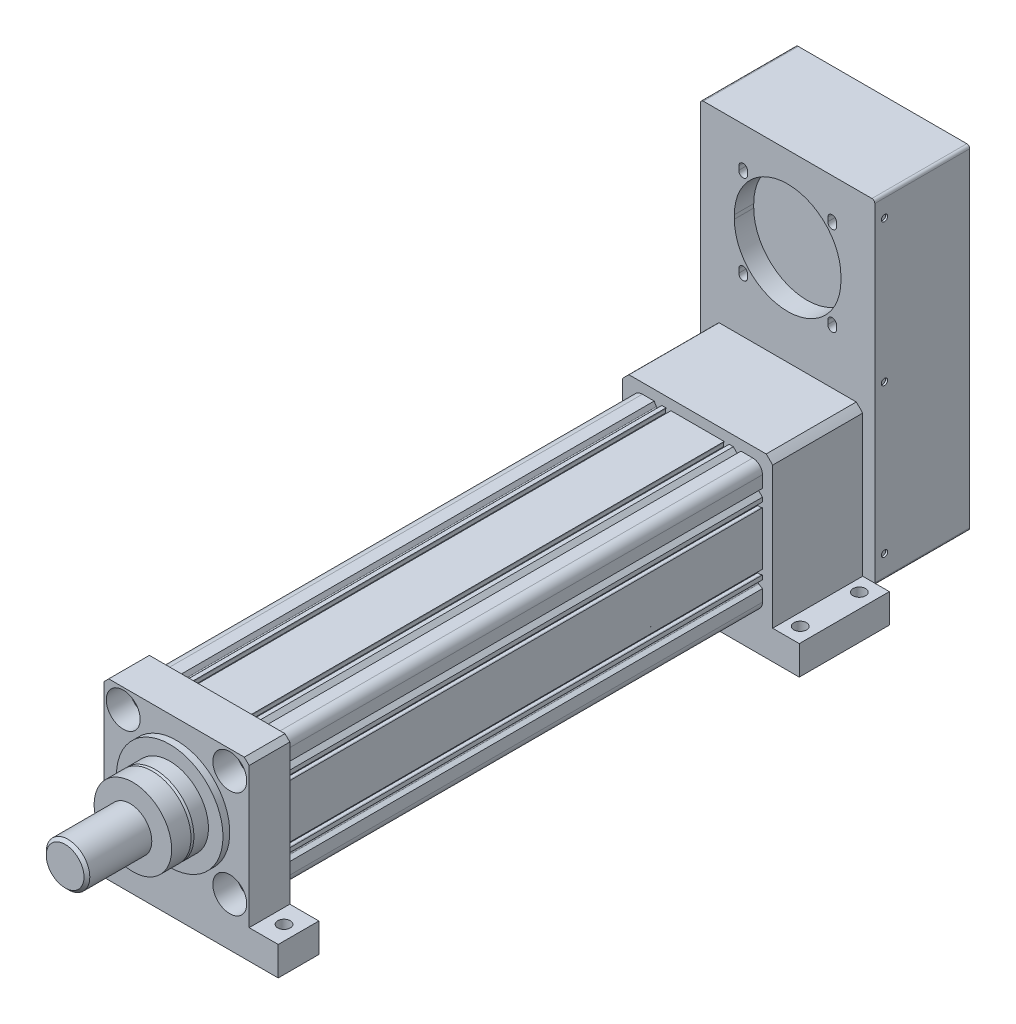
from build123d import *

# Parameters (mm, degrees)
SKETCH_1_R          = 6
EXTRUDE_1_DEPTH     = 496
EXTRUDE_1_2_DEPTH   = 42
SKETCH_3_R          = 6.5
SKETCH_3_R_2        = 8.5
CUT_EXTRUDE_1_DEPTH = 42
SKETCH_3_3_R        = 17.5
SKETCH_3_3_R_2      = 8.5
CUT_EXTRUDE_2_DEPTH = 24
SKETCH_3_4_R        = 55
EXTRUDE_2_DEPTH     = 7
SKETCH_4_R          = 40
EXTRUDE_3_DEPTH     = 18
CHAMFER_1_SIZE      = 3
CHAMFER_1_SIZE2     = 1.091910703
SKETCH_5_R          = 40
EXTRUDE_4_DEPTH     = 20
SKETCH_6_R          = 16.5
EXTRUDE_5_DEPTH     = 3
SKETCH_7_R          = 22.5
EXTRUDE_6_DEPTH     = 67
FILLET_1_R          = 1
CHAMFER_2_SIZE      = 3
EXTRUDE_7_DEPTH     = 93
SKETCH_12_W         = 180
SKETCH_12_H         = 345
EXTRUDE_9_DEPTH     = 98
CUT_EXTRUDE_5_DEPTH = 20
CUT_EXTRUDE_6_DEPTH = 20
SKETCH_15_R         = 3.25
CUT_EXTRUDE_7_DEPTH = 2
CUT_EXTRUDE_START   = -2
SKETCH_14_R         = 3.25
CUT_EXTRUDE_8_DEPTH = 2
SKETCH_16_W         = 210
SKETCH_16_H         = 93
SKETCH_16_R         = 6.5
EXTRUDE_10_DEPTH    = 27.5
SKETCH_17_W         = 210
SKETCH_17_H         = 42
SKETCH_17_R         = 6.5
EXTRUDE_11_DEPTH    = 30
FILLET_2_R          = 3
SKETCH_18_W         = 210
SKETCH_18_H         = 93
SKETCH_18_R         = 6.5
EXTRUDE_12_DEPTH    = 2.5


with BuildPart() as part:
    # Sketch 1 → Extrude 1 (new body)
    with BuildSketch(Plane.XY):
        with BuildLine():
            Line((57, 67), (44.8, 67))
            Line((44.8, 67), (42.56486134, 63.12862628))
            ThreePointArc((42.56486134, 63.12862628), (41.829362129, 62.637181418), (40.991729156, 62.921519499))
            Line((40.991729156, 62.921519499), (36.913248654, 67))
            Line((36.913248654, 67), (32.6, 67))
            Line((32.6, 67), (32.6, 66.1))
            Line((32.6, 66.1), (33.2, 65.5))
            Line((33.2, 65.5), (33.2, 62))
            Line((33.2, 62), (26.9, 62))
            Line((26.9, 62), (26.9, 65.5))
            Line((26.9, 65.5), (27.5, 66.1))
            Line((27.5, 66.1), (27.5, 67))
            Line((27.5, 67), (0, 67))
            Line((0, 67), (-27.5, 67))
            Line((-27.5, 67), (-27.5, 66.1))
            Line((-27.5, 66.1), (-26.9, 65.5))
            Line((-26.9, 65.5), (-26.9, 62))
            Line((-26.9, 62), (-33.2, 62))
            Line((-33.2, 62), (-33.2, 65.5))
            Line((-33.2, 65.5), (-32.6, 66.1))
            Line((-32.6, 66.1), (-32.6, 67))
            Line((-32.6, 67), (-36.913248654, 67))
            Line((-36.913248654, 67), (-40.991729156, 62.921519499))
            ThreePointArc((-40.991729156, 62.921519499), (-41.829362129, 62.637181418), (-42.56486134, 63.12862628))
            Line((-42.56486134, 63.12862628), (-44.8, 67))
            Line((-44.8, 67), (-57, 67))
            ThreePointArc((-57, 67), (-64.071067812, 64.071067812), (-67, 57))
            Line((-67, 57), (-67, 44.8))
            Line((-67, 44.8), (-63.12862628, 42.56486134))
            ThreePointArc((-63.12862628, 42.56486134), (-62.637181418, 41.829362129), (-62.921519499, 40.991729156))
            Line((-62.921519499, 40.991729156), (-67, 36.913248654))
            Line((-67, 36.913248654), (-67, 32.6))
            Line((-67, 32.6), (-66.1, 32.6))
            Line((-66.1, 32.6), (-65.5, 33.2))
            Line((-65.5, 33.2), (-62, 33.2))
            Line((-62, 33.2), (-62, 26.9))
            Line((-62, 26.9), (-65.5, 26.9))
            Line((-65.5, 26.9), (-66.1, 27.5))
            Line((-66.1, 27.5), (-67, 27.5))
            Line((-67, 27.5), (-67, 0))
            Line((-67, 0), (-67, -27.5))
            Line((-67, -27.5), (-66.1, -27.5))
            Line((-66.1, -27.5), (-65.5, -26.9))
            Line((-65.5, -26.9), (-62, -26.9))
            Line((-62, -26.9), (-62, -33.2))
            Line((-62, -33.2), (-65.5, -33.2))
            Line((-65.5, -33.2), (-66.1, -32.6))
            Line((-66.1, -32.6), (-67, -32.6))
            Line((-67, -32.6), (-67, -36.913248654))
            Line((-67, -36.913248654), (-62.921519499, -40.991729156))
            ThreePointArc((-62.921519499, -40.991729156), (-62.637181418, -41.829362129), (-63.12862628, -42.56486134))
            Line((-63.12862628, -42.56486134), (-67, -44.8))
            Line((-67, -44.8), (-67, -57))
            ThreePointArc((-67, -57), (-64.071067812, -64.071067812), (-57, -67))
            Line((-57, -67), (-44.8, -67))
            Line((-44.8, -67), (-42.56486134, -63.12862628))
            ThreePointArc((-42.56486134, -63.12862628), (-41.829362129, -62.637181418), (-40.991729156, -62.921519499))
            Line((-40.991729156, -62.921519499), (-36.913248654, -67))
            Line((-36.913248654, -67), (36.913248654, -67))
            Line((36.913248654, -67), (40.991729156, -62.921519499))
            ThreePointArc((40.991729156, -62.921519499), (41.829362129, -62.637181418), (42.56486134, -63.12862628))
            Line((42.56486134, -63.12862628), (44.8, -67))
            Line((44.8, -67), (57, -67))
            ThreePointArc((57, -67), (64.071067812, -64.071067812), (67, -57))
            Line((67, -57), (67, -44.8))
            Line((67, -44.8), (63.12862628, -42.56486134))
            ThreePointArc((63.12862628, -42.56486134), (62.637181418, -41.829362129), (62.921519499, -40.991729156))
            Line((62.921519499, -40.991729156), (67, -36.913248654))
            Line((67, -36.913248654), (67, -32.6))
            Line((67, -32.6), (66.1, -32.6))
            Line((66.1, -32.6), (65.5, -33.2))
            Line((65.5, -33.2), (62, -33.2))
            Line((62, -33.2), (62, -26.9))
            Line((62, -26.9), (65.5, -26.9))
            Line((65.5, -26.9), (66.1, -27.5))
            Line((66.1, -27.5), (67, -27.5))
            Line((67, -27.5), (67, 0))
            Line((67, 0), (67, 27.5))
            Line((67, 27.5), (66.1, 27.5))
            Line((66.1, 27.5), (65.5, 26.9))
            Line((65.5, 26.9), (62, 26.9))
            Line((62, 26.9), (62, 33.2))
            Line((62, 33.2), (65.5, 33.2))
            Line((65.5, 33.2), (66.1, 32.6))
            Line((66.1, 32.6), (67, 32.6))
            Line((67, 32.6), (67, 36.913248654))
            Line((67, 36.913248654), (62.921519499, 40.991729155))
            ThreePointArc((62.921519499, 40.991729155), (62.637181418, 41.829362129), (63.12862628, 42.56486134))
            Line((63.12862628, 42.56486134), (67, 44.8))
            Line((67, 44.8), (67, 57))
            ThreePointArc((67, 57), (64.071067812, 64.071067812), (57, 67))
        make_face()
        with Locations((-55, 55)):
            Circle(SKETCH_1_R, mode=Mode.SUBTRACT)
        with Locations((55, 55)):
            Circle(SKETCH_1_R, mode=Mode.SUBTRACT)
        with Locations((-55, -55)):
            Circle(SKETCH_1_R, mode=Mode.SUBTRACT)
        with Locations((55, -55)):
            Circle(SKETCH_1_R, mode=Mode.SUBTRACT)
        with BuildLine():
            Line((41.774779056, 51.785063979), (43.601329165, 54.94874157))
            ThreePointArc((43.601329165, 54.94874157), (43.701229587, 55.707560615), (43.235303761, 56.314766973))
            Line((43.235303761, 56.314766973), (39.616756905, 58.403935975))
            ThreePointArc((39.616756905, 58.403935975), (39.337726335, 58.513191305), (39.038853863, 58.534871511))
            Line((39.038853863, 58.534871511), (35.747329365, 58.277670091))
            ThreePointArc((35.747329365, 58.277670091), (35.481311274, 58.1068038), (35.28193171, 57.86142918))
            Line((35.28193171, 57.86142918), (34.274000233, 56.115640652))
            ThreePointArc((34.274000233, 56.115640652), (34.174099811, 55.356821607), (34.640025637, 54.749615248))
            Line((34.640025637, 54.749615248), (40.408753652, 51.419038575))
            ThreePointArc((40.408753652, 51.419038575), (41.167572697, 51.319138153), (41.774779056, 51.785063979))
        make_face(mode=Mode.SUBTRACT)
        with BuildLine():
            Line((51.785063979, 41.774779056), (54.94874157, 43.601329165))
            ThreePointArc((54.94874157, 43.601329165), (55.707560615, 43.701229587), (56.314766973, 43.235303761))
            Line((56.314766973, 43.235303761), (58.403935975, 39.616756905))
            ThreePointArc((58.403935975, 39.616756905), (58.513191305, 39.337726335), (58.534871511, 39.038853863))
            Line((58.534871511, 39.038853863), (58.277670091, 35.747329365))
            ThreePointArc((58.277670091, 35.747329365), (58.1068038, 35.481311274), (57.86142918, 35.28193171))
            Line((57.86142918, 35.28193171), (56.115640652, 34.274000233))
            ThreePointArc((56.115640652, 34.274000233), (55.356821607, 34.174099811), (54.749615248, 34.640025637))
            Line((54.749615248, 34.640025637), (51.419038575, 40.408753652))
            ThreePointArc((51.419038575, 40.408753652), (51.319138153, 41.167572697), (51.785063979, 41.774779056))
        make_face(mode=Mode.SUBTRACT)
        with BuildLine():
            Line((-57.86142918, 35.28193171), (-56.115640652, 34.274000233))
            ThreePointArc((-56.115640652, 34.274000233), (-55.356821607, 34.174099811), (-54.749615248, 34.640025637))
            Line((-54.749615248, 34.640025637), (-51.419038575, 40.408753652))
            ThreePointArc((-51.419038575, 40.408753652), (-51.319138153, 41.167572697), (-51.785063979, 41.774779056))
            Line((-51.785063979, 41.774779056), (-54.94874157, 43.601329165))
            ThreePointArc((-54.94874157, 43.601329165), (-55.707560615, 43.701229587), (-56.314766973, 43.235303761))
            Line((-56.314766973, 43.235303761), (-58.403935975, 39.616756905))
            ThreePointArc((-58.403935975, 39.616756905), (-58.513191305, 39.337726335), (-58.534871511, 39.038853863))
            Line((-58.534871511, 39.038853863), (-58.277670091, 35.747329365))
            ThreePointArc((-58.277670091, 35.747329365), (-58.1068038, 35.481311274), (-57.86142918, 35.28193171))
        make_face(mode=Mode.SUBTRACT)
        with BuildLine():
            Line((-33.360371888, -64.600232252), (-19.423193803, -64.600232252))
            ThreePointArc((-19.423193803, -64.600232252), (-18.434155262, -63.747889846), (-19.1311157, -62.643837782))
            ThreePointArc((-19.1311157, -62.643837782), (-26.690004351, -59.815496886), (-33.843674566, -56.079012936))
            ThreePointArc((-33.843674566, -56.079012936), (-34.851952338, -56.064348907), (-35.360371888, -56.935181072))
            Line((-35.360371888, -56.935181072), (-35.360371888, -62.600232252))
            Line((-35.360371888, -62.600232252), (-33.360371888, -64.600232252))
        make_face(mode=Mode.SUBTRACT)
        with BuildLine():
            Line((35.360371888, -62.600232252), (33.360371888, -64.600232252))
            Line((33.360371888, -64.600232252), (19.423193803, -64.600232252))
            ThreePointArc((19.423193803, -64.600232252), (18.434155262, -63.747889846), (19.1311157, -62.643837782))
            ThreePointArc((19.1311157, -62.643837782), (26.690004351, -59.815496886), (33.843674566, -56.079012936))
            ThreePointArc((33.843674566, -56.079012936), (34.851952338, -56.064348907), (35.360371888, -56.935181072))
            Line((35.360371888, -56.935181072), (35.360371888, -62.600232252))
        make_face(mode=Mode.SUBTRACT)
        with BuildLine():
            Line((51.785063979, -41.774779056), (54.94874157, -43.601329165))
            ThreePointArc((54.94874157, -43.601329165), (55.707560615, -43.701229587), (56.314766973, -43.235303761))
            Line((56.314766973, -43.235303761), (58.403935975, -39.616756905))
            ThreePointArc((58.403935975, -39.616756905), (58.513191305, -39.337726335), (58.534871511, -39.038853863))
            Line((58.534871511, -39.038853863), (58.277670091, -35.747329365))
            ThreePointArc((58.277670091, -35.747329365), (58.1068038, -35.481311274), (57.86142918, -35.28193171))
            Line((57.86142918, -35.28193171), (56.115640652, -34.274000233))
            ThreePointArc((56.115640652, -34.274000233), (55.356821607, -34.174099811), (54.749615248, -34.640025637))
            Line((54.749615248, -34.640025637), (51.419038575, -40.408753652))
            ThreePointArc((51.419038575, -40.408753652), (51.319138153, -41.167572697), (51.785063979, -41.774779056))
        make_face(mode=Mode.SUBTRACT)
        with BuildLine():
            Line((-57.86142918, -35.28193171), (-56.115640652, -34.274000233))
            ThreePointArc((-56.115640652, -34.274000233), (-55.356821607, -34.174099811), (-54.749615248, -34.640025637))
            Line((-54.749615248, -34.640025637), (-51.419038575, -40.408753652))
            ThreePointArc((-51.419038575, -40.408753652), (-51.319138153, -41.167572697), (-51.785063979, -41.774779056))
            Line((-51.785063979, -41.774779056), (-54.94874157, -43.601329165))
            ThreePointArc((-54.94874157, -43.601329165), (-55.707560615, -43.701229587), (-56.314766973, -43.235303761))
            Line((-56.314766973, -43.235303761), (-58.403935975, -39.616756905))
            ThreePointArc((-58.403935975, -39.616756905), (-58.513191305, -39.337726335), (-58.534871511, -39.038853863))
            Line((-58.534871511, -39.038853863), (-58.277670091, -35.747329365))
            ThreePointArc((-58.277670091, -35.747329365), (-58.1068038, -35.481311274), (-57.86142918, -35.28193171))
        make_face(mode=Mode.SUBTRACT)
        with BuildLine():
            Line((-41.774779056, 51.785063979), (-43.601329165, 54.94874157))
            ThreePointArc((-43.601329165, 54.94874157), (-43.701229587, 55.707560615), (-43.235303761, 56.314766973))
            Line((-43.235303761, 56.314766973), (-39.616756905, 58.403935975))
            ThreePointArc((-39.616756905, 58.403935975), (-39.337726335, 58.513191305), (-39.038853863, 58.534871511))
            Line((-39.038853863, 58.534871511), (-35.747329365, 58.277670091))
            ThreePointArc((-35.747329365, 58.277670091), (-35.481311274, 58.1068038), (-35.28193171, 57.86142918))
            Line((-35.28193171, 57.86142918), (-34.274000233, 56.115640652))
            ThreePointArc((-34.274000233, 56.115640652), (-34.174099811, 55.356821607), (-34.640025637, 54.749615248))
            Line((-34.640025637, 54.749615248), (-40.408753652, 51.419038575))
            ThreePointArc((-40.408753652, 51.419038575), (-41.167572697, 51.319138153), (-41.774779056, 51.785063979))
        make_face(mode=Mode.SUBTRACT)
        with BuildLine():
            ThreePointArc((62.5, 0), (0, 62.5), (-62.5, 0))
            ThreePointArc((-62.5, 0), (0, -62.5), (62.5, 0))
        make_face(mode=Mode.SUBTRACT)
    extrude(amount=EXTRUDE_1_DEPTH)

    # Sketch 2 → Extrude 1 2 (add)
    with BuildSketch(Plane.XY.offset(496)):
        Polygon((-75, 70), (-70, 75), (70, 75), (75, 70), (75, -70), (75, -75), (70, -75), (-70, -75), (-75, -75), (-75, -70), align=None)
    extrude(amount=EXTRUDE_1_2_DEPTH)

    # Sketch 3 → Cut-Extrude 1 (cut)
    with BuildSketch(Plane.XY.offset(538)):
        with Locations((-85, 20)):
            Circle(SKETCH_3_R)
        with Locations((-85, -20)):
            Circle(SKETCH_3_R)
        with Locations((-85, -60)):
            Circle(SKETCH_3_R)
        with Locations((-55, -55)):
            Circle(SKETCH_3_R_2)
        with Locations((-55, 55)):
            Circle(SKETCH_3_R_2)
        with Locations((55, 55)):
            Circle(SKETCH_3_R_2)
        with Locations((85, 60)):
            Circle(SKETCH_3_R)
        with Locations((85, 20)):
            Circle(SKETCH_3_R)
        with Locations((85, -20)):
            Circle(SKETCH_3_R)
        with Locations((85, -60)):
            Circle(SKETCH_3_R)
        with Locations((55, -55)):
            Circle(SKETCH_3_R_2)
        with Locations((-85, 60)):
            Circle(SKETCH_3_R)
    extrude(amount=-CUT_EXTRUDE_1_DEPTH, mode=Mode.SUBTRACT)

    # Sketch 3_3 → Cut-Extrude 2 (cut)
    # profile 1 of 4: a face of its own
    with BuildSketch(Plane.XY.offset(538)):
        with Locations((55, 55)):
            Circle(SKETCH_3_3_R)
        with Locations((55, 55)):
            Circle(SKETCH_3_3_R_2, mode=Mode.SUBTRACT)
    # profile 2 of 4: a face of its own
    with BuildSketch(Plane.XY.offset(538)):
        with Locations((55, -55)):
            Circle(SKETCH_3_3_R)
        with Locations((55, -55)):
            Circle(SKETCH_3_3_R_2, mode=Mode.SUBTRACT)
    # profile 3 of 4: a face of its own
    with BuildSketch(Plane.XY.offset(538)):
        with Locations((-55, -55)):
            Circle(SKETCH_3_3_R)
        with Locations((-55, -55)):
            Circle(SKETCH_3_3_R_2, mode=Mode.SUBTRACT)
    # profile 4 of 4: a face of its own
    with BuildSketch(Plane.XY.offset(538)):
        with Locations((-55, 55)):
            Circle(SKETCH_3_3_R)
    extrude(amount=-CUT_EXTRUDE_2_DEPTH, mode=Mode.SUBTRACT)

    # Sketch 3_4 → Extrude 2 (add)
    with BuildSketch(Plane.XY.offset(538)):
        with Locations(Location((0, 0, 0), (0, 0, 180))):
            Circle(SKETCH_3_4_R)
    extrude(amount=EXTRUDE_2_DEPTH)

    # Sketch 4 → Extrude 3 (add)
    with BuildSketch(Plane.XY.offset(545)):
        Circle(SKETCH_4_R)
    extrude(amount=EXTRUDE_3_DEPTH)

    # Chamfer 1
    chamfer_1_edges = [part.edges().sort_by_distance(p)[0] for p in [
        (-40, 0, 563),
    ]]
    chamfer_1_side = [part.faces().sort_by_distance(p)[0] for p in [
        (-40, 0, 554),
    ]]
    chamfer(chamfer_1_edges, length=CHAMFER_1_SIZE, length2=CHAMFER_1_SIZE2, reference=chamfer_1_side[0])

    # Sketch 5 → Extrude 4 (add)
    with BuildSketch(Plane.XY.offset(563)):
        Circle(SKETCH_5_R)
    extrude(amount=EXTRUDE_4_DEPTH)

    # Sketch 6 → Extrude 5 (add)
    with BuildSketch(Plane.XY.offset(583)):
        Circle(SKETCH_6_R)
    extrude(amount=EXTRUDE_5_DEPTH)

    # Sketch 7 → Extrude 6 (add)
    with BuildSketch(Plane.XY.offset(586)):
        Circle(SKETCH_7_R)
    extrude(amount=EXTRUDE_6_DEPTH)

    # Fillet 1
    fillet_1_edges = [part.edges().sort_by_distance(p)[0] for p in [
        (-16.5, 0, 583),
    ]]
    fillet(fillet_1_edges, radius=FILLET_1_R)

    # Chamfer 2
    chamfer_2_edges = [part.edges().sort_by_distance(p)[0] for p in [
        (-22.5, 0, 653),
    ]]
    chamfer(chamfer_2_edges, length=CHAMFER_2_SIZE)

    # Sketch 8 → Extrude 7 (add)
    with BuildSketch(Plane(origin=(0, 0, 0), x_dir=(-1, 0, 0), z_dir=(0, 0, -1))):
        with BuildLine():
            Line((77.5, -70.843136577), (77.5, -77.5))
            Line((77.5, -77.5), (70.843136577, -77.5))
            Line((70.843136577, -77.5), (-70.843136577, -77.5))
            Line((-70.843136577, -77.5), (-77.5, -77.5))
            Line((-77.5, -77.5), (-77.5, -70.843136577))
            Line((-77.5, -70.843136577), (-77.5, 70.843136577))
            ThreePointArc((-77.5, 70.843136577), (-74.246212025, 74.246212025), (-70.843136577, 77.5))
            Line((-70.843136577, 77.5), (70.843136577, 77.5))
            ThreePointArc((70.843136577, 77.5), (74.246212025, 74.246212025), (77.5, 70.843136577))
            Line((77.5, 70.843136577), (77.5, -70.843136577))
        make_face()
    extrude(amount=EXTRUDE_7_DEPTH)

    # Sketch 12 → Extrude 9 (add)
    with BuildSketch(Plane(origin=(0, 0, -93), x_dir=(-1, 0, 0), z_dir=(0, 0, -1))):
        with Locations((0, 95)):
            Rectangle(SKETCH_12_W, SKETCH_12_H)
    extrude(amount=EXTRUDE_9_DEPTH)

    # Sketch 13 → Cut-Extrude 5 (cut)
    with BuildSketch(Plane.XY.offset(-93)):
        with BuildLine():
            Line((-55, 182), (-55, 178))
            ThreePointArc((-55, 178), (0, 123), (55, 178))
            Line((55, 178), (55, 182))
            ThreePointArc((55, 182), (0, 237), (-55, 182))
        make_face()
    extrude(amount=-CUT_EXTRUDE_5_DEPTH, mode=Mode.SUBTRACT)

    # Sketch 13_3 → Cut-Extrude 6 (cut)
    with BuildSketch(Plane.XY.offset(-93)):
        with BuildLine():
            Line((-50.461940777, 223.961940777), (-50.461940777, 227.961940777))
            ThreePointArc((-50.461940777, 227.961940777), (-45.961940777, 232.461940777), (-41.461940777, 227.961940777))
            Line((-41.461940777, 227.961940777), (-41.461940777, 223.961940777))
            ThreePointArc((-41.461940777, 223.961940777), (-45.961940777, 219.461940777), (-50.461940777, 223.961940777))
        make_face()
        with BuildLine():
            Line((50.461940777, 223.961940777), (50.461940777, 227.961940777))
            ThreePointArc((50.461940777, 227.961940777), (45.961940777, 232.461940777), (41.461940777, 227.961940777))
            Line((41.461940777, 227.961940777), (41.461940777, 223.961940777))
            ThreePointArc((41.461940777, 223.961940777), (45.961940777, 219.461940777), (50.461940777, 223.961940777))
        make_face()
        with BuildLine():
            Line((50.461940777, 136.038059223), (50.461940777, 132.038059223))
            ThreePointArc((50.461940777, 132.038059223), (45.961940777, 127.538059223), (41.461940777, 132.038059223))
            Line((41.461940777, 132.038059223), (41.461940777, 136.038059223))
            ThreePointArc((41.461940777, 136.038059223), (45.961940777, 140.538059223), (50.461940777, 136.038059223))
        make_face()
        with BuildLine():
            Line((-50.461940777, 136.038059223), (-50.461940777, 132.038059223))
            ThreePointArc((-50.461940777, 132.038059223), (-45.961940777, 127.538059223), (-41.461940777, 132.038059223))
            Line((-41.461940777, 132.038059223), (-41.461940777, 136.038059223))
            ThreePointArc((-41.461940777, 136.038059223), (-45.961940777, 140.538059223), (-50.461940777, 136.038059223))
        make_face()
    extrude(amount=-CUT_EXTRUDE_6_DEPTH, mode=Mode.SUBTRACT)

    # Sketch 15 → Cut-Extrude 7 (cut)
    with BuildSketch(Plane(origin=(90, 0, 0), x_dir=(0, 0, -1), z_dir=(1, 0, 0))):
        with Locations(Location((103, 246.5, 0), (0, 0, 90))):
            Circle(SKETCH_15_R)
        with Locations(Location((103, 100, 0), (0, 0, 90))):
            Circle(SKETCH_15_R)
        with Locations(Location((103, -53.5, 0), (0, 0, 90))):
            Circle(SKETCH_15_R)
    extrude(amount=-CUT_EXTRUDE_7_DEPTH, mode=Mode.SUBTRACT)

    # Sketch 14 → Cut-Extrude 8 (cut)
    with BuildSketch(Plane.ZY.offset(90).offset(CUT_EXTRUDE_START)):
        with Locations(Location((-103, -53.5, 0), (0, 0, 90))):
            Circle(SKETCH_14_R)
        with Locations(Location((-103, 100, 0), (0, 0, 90))):
            Circle(SKETCH_14_R)
        with Locations(Location((-103, 246.5, 0), (0, 0, 90))):
            Circle(SKETCH_14_R)
    extrude(amount=CUT_EXTRUDE_8_DEPTH, mode=Mode.SUBTRACT)

    # Sketch 17 → Extrude 11 (add)
    with BuildSketch(Plane.XZ.offset(75)):
        with Locations((0, 517)):
            Rectangle(SKETCH_17_W, SKETCH_17_H)
        with Locations(Location((-90, 517, 0), (0, 0, 270))):
            Circle(SKETCH_17_R, mode=Mode.SUBTRACT)
        with Locations(Location((90, 517, 0), (0, 0, 270))):
            Circle(SKETCH_17_R, mode=Mode.SUBTRACT)
    extrude(amount=EXTRUDE_11_DEPTH)

    # Fillet 2
    fillet_2_edges = [part.edges().sort_by_distance(p)[0] for p in [
        (-90, -77.5, -142),
        (-90, 267.5, -142),
        (90, 267.5, -142),
        (90, -77.5, -142),
    ]]
    fillet(fillet_2_edges, radius=FILLET_2_R)



with BuildPart() as body_2:
    # Sketch 16 → Extrude 10 (new body)
    with BuildSketch(Plane.XZ.offset(77.5)):
        with Locations((0, -46.5)):
            Rectangle(SKETCH_16_W, SKETCH_16_H)
        with Locations(Location((-90, -77, 0), (0, 0, 270))):
            Circle(SKETCH_16_R, mode=Mode.SUBTRACT)
        with Locations(Location((90, -77, 0), (0, 0, 270))):
            Circle(SKETCH_16_R, mode=Mode.SUBTRACT)
        with Locations(Location((90, -16, 0), (0, 0, 90))):
            Circle(SKETCH_16_R, mode=Mode.SUBTRACT)
        with Locations(Location((-90, -17, 0), (0, 0, 90))):
            Circle(SKETCH_16_R, mode=Mode.SUBTRACT)
    extrude(amount=EXTRUDE_10_DEPTH)


with BuildPart() as part_1:
    add(part.part)

    add(body_2.part)  # Extrude 12 merges body 2
    # Sketch 18 → Extrude 12 (add)
    with BuildSketch(Plane(origin=(0, -77.5, 0), x_dir=(1, 0, 0), z_dir=(0, 1, 0))):
        with Locations((0, 46.5)):
            Rectangle(SKETCH_18_W, SKETCH_18_H)
        with Locations(Location((-90, 17, 0), (0, 0, 270))):
            Circle(SKETCH_18_R, mode=Mode.SUBTRACT)
        with Locations(Location((-90, 77, 0), (0, 0, 270))):
            Circle(SKETCH_18_R, mode=Mode.SUBTRACT)
        with Locations(Location((90, 16, 0), (0, 0, 270))):
            Circle(SKETCH_18_R, mode=Mode.SUBTRACT)
        with Locations(Location((90, 77, 0), (0, 0, 270))):
            Circle(SKETCH_18_R, mode=Mode.SUBTRACT)
    extrude(amount=EXTRUDE_12_DEPTH)


solid = part_1.part
